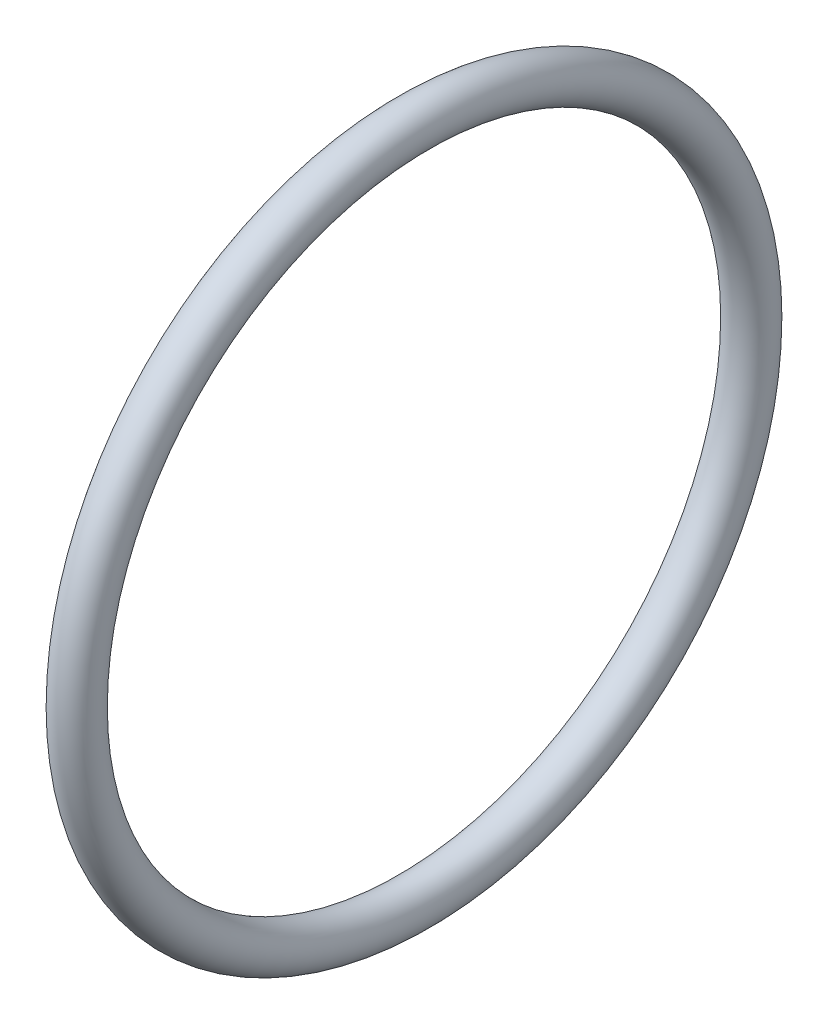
ISO-10303-21;
HEADER;
FILE_DESCRIPTION(('STEP AP214'),'2;1');
FILE_NAME('part.step','',(''),(''),'','','');
FILE_SCHEMA(('AUTOMOTIVE_DESIGN { 1 0 10303 214 1 1 1 1 }'));
ENDSEC;
DATA;
#1=APPLICATION_CONTEXT('core data for automotive mechanical design processes');
#2=APPLICATION_PROTOCOL_DEFINITION('international standard','automotive_design',2000,#1);
#3=PRODUCT_CONTEXT('',#1,'mechanical');
#4=PRODUCT('Part','Part','',(#3));
#5=PRODUCT_RELATED_PRODUCT_CATEGORY('part','',(#4));
#6=PRODUCT_DEFINITION_FORMATION('','',#4);
#7=PRODUCT_DEFINITION_CONTEXT('part definition',#1,'design');
#8=PRODUCT_DEFINITION('design','',#6,#7);
#9=PRODUCT_DEFINITION_SHAPE('','',#8);
#10=(LENGTH_UNIT() NAMED_UNIT(*) SI_UNIT(.MILLI.,.METRE.));
#11=(NAMED_UNIT(*) PLANE_ANGLE_UNIT() SI_UNIT($,.RADIAN.));
#12=(NAMED_UNIT(*) SI_UNIT($,.STERADIAN.) SOLID_ANGLE_UNIT());
#13=UNCERTAINTY_MEASURE_WITH_UNIT(LENGTH_MEASURE(1.E-05),#10,'distance_accuracy_value','');
#14=(GEOMETRIC_REPRESENTATION_CONTEXT(3) GLOBAL_UNCERTAINTY_ASSIGNED_CONTEXT((#13)) GLOBAL_UNIT_ASSIGNED_CONTEXT((#10,
#11,#12)) REPRESENTATION_CONTEXT('',''));
#15=CARTESIAN_POINT('',(0.,0.,0.));
#16=DIRECTION('',(0.,0.,1.));
#17=DIRECTION('',(1.,0.,0.));
#18=AXIS2_PLACEMENT_3D('',#15,#16,#17);
#19=CARTESIAN_POINT('',(0.,0.,0.));
#20=DIRECTION('',(1.,0.,0.));
#21=DIRECTION('',(0.,0.,-1.));
#22=AXIS2_PLACEMENT_3D('',#19,#20,#21);
#23=TOROIDAL_SURFACE('',#22,27.497214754,1.7653);
#24=CARTESIAN_POINT('',(0.,0.,-29.262514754));
#25=VERTEX_POINT('',#24);
#26=VERTEX_LOOP('',#25);
#27=FACE_BOUND('',#26,.T.);
#28=ADVANCED_FACE('F40',(#27),#23,.T.);
#29=CLOSED_SHELL('',(#28));
#30=MANIFOLD_SOLID_BREP('B2',#29);
#31=ADVANCED_BREP_SHAPE_REPRESENTATION('',(#18,#30),#14);
#32=SHAPE_DEFINITION_REPRESENTATION(#9,#31);
ENDSEC;
END-ISO-10303-21;
